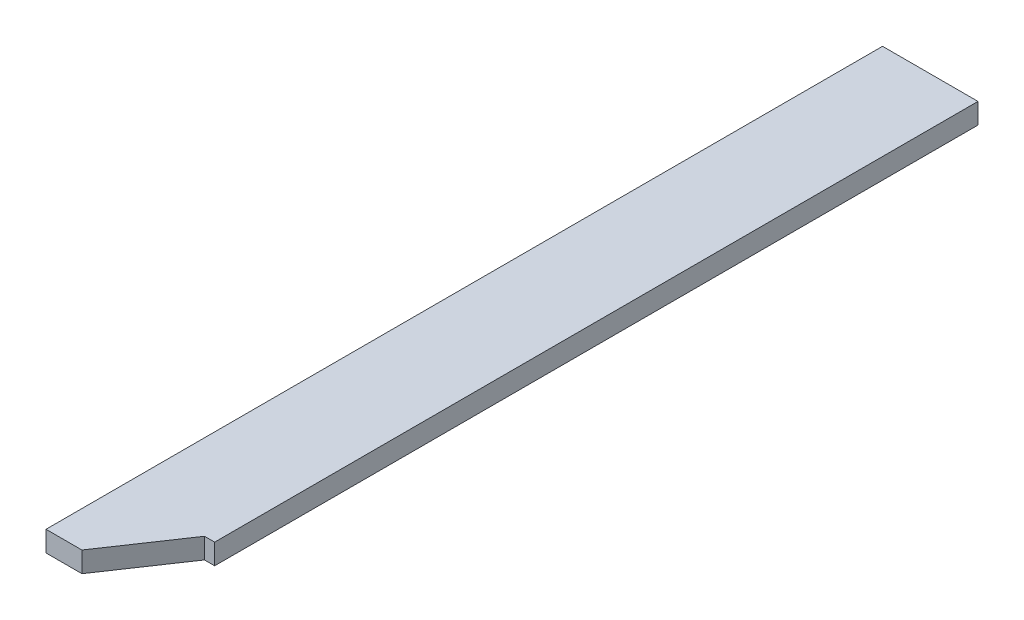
ISO-10303-21;
HEADER;
FILE_DESCRIPTION(('STEP AP214'),'2;1');
FILE_NAME('part.step','',(''),(''),'','','');
FILE_SCHEMA(('AUTOMOTIVE_DESIGN { 1 0 10303 214 1 1 1 1 }'));
ENDSEC;
DATA;
#1=APPLICATION_CONTEXT('core data for automotive mechanical design processes');
#2=APPLICATION_PROTOCOL_DEFINITION('international standard','automotive_design',2000,#1);
#3=PRODUCT_CONTEXT('',#1,'mechanical');
#4=PRODUCT('Part','Part','',(#3));
#5=PRODUCT_RELATED_PRODUCT_CATEGORY('part','',(#4));
#6=PRODUCT_DEFINITION_FORMATION('','',#4);
#7=PRODUCT_DEFINITION_CONTEXT('part definition',#1,'design');
#8=PRODUCT_DEFINITION('design','',#6,#7);
#9=PRODUCT_DEFINITION_SHAPE('','',#8);
#10=(LENGTH_UNIT() NAMED_UNIT(*) SI_UNIT(.MILLI.,.METRE.));
#11=(NAMED_UNIT(*) PLANE_ANGLE_UNIT() SI_UNIT($,.RADIAN.));
#12=(NAMED_UNIT(*) SI_UNIT($,.STERADIAN.) SOLID_ANGLE_UNIT());
#13=UNCERTAINTY_MEASURE_WITH_UNIT(LENGTH_MEASURE(1.E-05),#10,'distance_accuracy_value','');
#14=(GEOMETRIC_REPRESENTATION_CONTEXT(3) GLOBAL_UNCERTAINTY_ASSIGNED_CONTEXT((#13)) GLOBAL_UNIT_ASSIGNED_CONTEXT((#10,
#11,#12)) REPRESENTATION_CONTEXT('',''));
#15=CARTESIAN_POINT('',(0.,0.,0.));
#16=DIRECTION('',(0.,0.,1.));
#17=DIRECTION('',(1.,0.,0.));
#18=AXIS2_PLACEMENT_3D('',#15,#16,#17);
#19=CARTESIAN_POINT('',(295.275,127.,-2587.67072));
#20=DIRECTION('',(-1.,0.,0.));
#21=DIRECTION('',(0.,0.,1.));
#22=AXIS2_PLACEMENT_3D('',#19,#20,#21);
#23=PLANE('',#22);
#24=DIRECTION('',(0.,0.,-1.));
#25=VECTOR('',#24,1.);
#26=CARTESIAN_POINT('',(295.275,127.,-2587.67072));
#27=LINE('',#26,#25);
#28=CARTESIAN_POINT('',(295.275,127.,2134.93330162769));
#29=VERTEX_POINT('',#28);
#30=CARTESIAN_POINT('',(295.275,127.,-2587.67072));
#31=VERTEX_POINT('',#30);
#32=EDGE_CURVE('E77',#29,#31,#27,.T.);
#33=ORIENTED_EDGE('',*,*,#32,.F.);
#34=DIRECTION('',(0.,-1.,0.));
#35=VECTOR('',#34,1.);
#36=CARTESIAN_POINT('',(295.275,127.,2134.93330162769));
#37=LINE('',#36,#35);
#38=CARTESIAN_POINT('',(295.275,0.,2134.93330162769));
#39=VERTEX_POINT('',#38);
#40=EDGE_CURVE('E119',#29,#39,#37,.T.);
#41=ORIENTED_EDGE('',*,*,#40,.T.);
#42=DIRECTION('',(0.,0.,-1.));
#43=VECTOR('',#42,1.);
#44=CARTESIAN_POINT('',(295.275,0.,-2587.67072));
#45=LINE('',#44,#43);
#46=CARTESIAN_POINT('',(295.275,0.,-2587.67072));
#47=VERTEX_POINT('',#46);
#48=EDGE_CURVE('E116',#39,#47,#45,.T.);
#49=ORIENTED_EDGE('',*,*,#48,.T.);
#50=DIRECTION('',(0.,-1.,0.));
#51=VECTOR('',#50,1.);
#52=CARTESIAN_POINT('',(295.275,127.,-2587.67072));
#53=LINE('',#52,#51);
#54=EDGE_CURVE('E11',#31,#47,#53,.T.);
#55=ORIENTED_EDGE('',*,*,#54,.F.);
#56=EDGE_LOOP('',(#33,#41,#49,#55));
#57=FACE_BOUND('',#56,.T.);
#58=ADVANCED_FACE('F32',(#57),#23,.F.);
#59=CARTESIAN_POINT('',(-295.275,127.,-2587.67072));
#60=DIRECTION('',(0.,0.,1.));
#61=DIRECTION('',(1.,0.,0.));
#62=AXIS2_PLACEMENT_3D('',#59,#60,#61);
#63=PLANE('',#62);
#64=DIRECTION('',(-1.,0.,0.));
#65=VECTOR('',#64,1.);
#66=CARTESIAN_POINT('',(-295.275,0.,-2587.67072));
#67=LINE('',#66,#65);
#68=CARTESIAN_POINT('',(-295.275,0.,-2587.67072));
#69=VERTEX_POINT('',#68);
#70=EDGE_CURVE('E118',#47,#69,#67,.T.);
#71=ORIENTED_EDGE('',*,*,#70,.T.);
#72=DIRECTION('',(0.,-1.,0.));
#73=VECTOR('',#72,1.);
#74=CARTESIAN_POINT('',(-295.275,127.,-2587.67072));
#75=LINE('',#74,#73);
#76=CARTESIAN_POINT('',(-295.275,127.,-2587.67072));
#77=VERTEX_POINT('',#76);
#78=EDGE_CURVE('E39',#77,#69,#75,.T.);
#79=ORIENTED_EDGE('',*,*,#78,.F.);
#80=DIRECTION('',(-1.,0.,0.));
#81=VECTOR('',#80,1.);
#82=CARTESIAN_POINT('',(-295.275,127.,-2587.67072));
#83=LINE('',#82,#81);
#84=EDGE_CURVE('E112',#31,#77,#83,.T.);
#85=ORIENTED_EDGE('',*,*,#84,.F.);
#86=ORIENTED_EDGE('',*,*,#54,.T.);
#87=EDGE_LOOP('',(#71,#79,#85,#86));
#88=FACE_BOUND('',#87,.T.);
#89=ADVANCED_FACE('F139',(#88),#63,.F.);
#90=CARTESIAN_POINT('',(-295.275,127.,-2587.67072));
#91=DIRECTION('',(1.,0.,0.));
#92=DIRECTION('',(0.,0.,-1.));
#93=AXIS2_PLACEMENT_3D('',#90,#91,#92);
#94=PLANE('',#93);
#95=DIRECTION('',(0.,0.,1.));
#96=VECTOR('',#95,1.);
#97=CARTESIAN_POINT('',(-295.275,0.,-2587.67072));
#98=LINE('',#97,#96);
#99=CARTESIAN_POINT('',(-295.275,0.,2587.67072));
#100=VERTEX_POINT('',#99);
#101=EDGE_CURVE('E72',#69,#100,#98,.T.);
#102=ORIENTED_EDGE('',*,*,#101,.T.);
#103=DIRECTION('',(0.,-1.,0.));
#104=VECTOR('',#103,1.);
#105=CARTESIAN_POINT('',(-295.275,127.,2587.67072));
#106=LINE('',#105,#104);
#107=CARTESIAN_POINT('',(-295.275,127.,2587.67072));
#108=VERTEX_POINT('',#107);
#109=EDGE_CURVE('E109',#108,#100,#106,.T.);
#110=ORIENTED_EDGE('',*,*,#109,.F.);
#111=DIRECTION('',(0.,0.,1.));
#112=VECTOR('',#111,1.);
#113=CARTESIAN_POINT('',(-295.275,127.,-2587.67072));
#114=LINE('',#113,#112);
#115=EDGE_CURVE('E55',#77,#108,#114,.T.);
#116=ORIENTED_EDGE('',*,*,#115,.F.);
#117=ORIENTED_EDGE('',*,*,#78,.T.);
#118=EDGE_LOOP('',(#102,#110,#116,#117));
#119=FACE_BOUND('',#118,.T.);
#120=ADVANCED_FACE('F123',(#119),#94,.F.);
#121=CARTESIAN_POINT('',(-295.275,127.,2587.67072));
#122=DIRECTION('',(0.,0.,-1.));
#123=DIRECTION('',(-1.,0.,0.));
#124=AXIS2_PLACEMENT_3D('',#121,#122,#123);
#125=PLANE('',#124);
#126=DIRECTION('',(1.,0.,0.));
#127=VECTOR('',#126,1.);
#128=CARTESIAN_POINT('',(-295.275,0.,2587.67072));
#129=LINE('',#128,#127);
#130=CARTESIAN_POINT('',(-73.0249999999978,0.,2587.67072));
#131=VERTEX_POINT('',#130);
#132=EDGE_CURVE('E106',#100,#131,#129,.T.);
#133=ORIENTED_EDGE('',*,*,#132,.T.);
#134=DIRECTION('',(0.,-1.,0.));
#135=VECTOR('',#134,1.);
#136=CARTESIAN_POINT('',(-73.0249999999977,127.,2587.67072));
#137=LINE('',#136,#135);
#138=CARTESIAN_POINT('',(-73.0249999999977,127.,2587.67072));
#139=VERTEX_POINT('',#138);
#140=EDGE_CURVE('E46',#139,#131,#137,.T.);
#141=ORIENTED_EDGE('',*,*,#140,.F.);
#142=DIRECTION('',(1.,0.,0.));
#143=VECTOR('',#142,1.);
#144=CARTESIAN_POINT('',(-295.275,127.,2587.67072));
#145=LINE('',#144,#143);
#146=EDGE_CURVE('E104',#108,#139,#145,.T.);
#147=ORIENTED_EDGE('',*,*,#146,.F.);
#148=ORIENTED_EDGE('',*,*,#109,.T.);
#149=EDGE_LOOP('',(#133,#141,#147,#148));
#150=FACE_BOUND('',#149,.T.);
#151=ADVANCED_FACE('F103',(#150),#125,.F.);
#152=CARTESIAN_POINT('',(295.275,127.,2587.67072));
#153=DIRECTION('',(0.,1.,0.));
#154=DIRECTION('',(0.,0.,1.));
#155=AXIS2_PLACEMENT_3D('',#152,#153,#154);
#156=PLANE('',#155);
#157=DIRECTION('',(1.,0.,0.));
#158=VECTOR('',#157,1.);
#159=CARTESIAN_POINT('',(295.275,127.,2134.93330162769));
#160=LINE('',#159,#158);
#161=CARTESIAN_POINT('',(232.350244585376,127.,2134.93330162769));
#162=VERTEX_POINT('',#161);
#163=EDGE_CURVE('E97',#162,#29,#160,.T.);
#164=ORIENTED_EDGE('',*,*,#163,.T.);
#165=ORIENTED_EDGE('',*,*,#32,.T.);
#166=ORIENTED_EDGE('',*,*,#84,.T.);
#167=ORIENTED_EDGE('',*,*,#115,.T.);
#168=ORIENTED_EDGE('',*,*,#146,.T.);
#169=DIRECTION('',(0.559192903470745,0.,-0.829037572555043));
#170=VECTOR('',#169,1.);
#171=CARTESIAN_POINT('',(232.350244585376,127.,2134.93330162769));
#172=LINE('',#171,#170);
#173=EDGE_CURVE('E93',#139,#162,#172,.T.);
#174=ORIENTED_EDGE('',*,*,#173,.T.);
#175=EDGE_LOOP('',(#164,#165,#166,#167,#168,#174));
#176=FACE_BOUND('',#175,.T.);
#177=ADVANCED_FACE('F108',(#176),#156,.T.);
#178=CARTESIAN_POINT('',(295.275,0.,2587.67072));
#179=DIRECTION('',(0.,1.,0.));
#180=DIRECTION('',(0.,0.,1.));
#181=AXIS2_PLACEMENT_3D('',#178,#179,#180);
#182=PLANE('',#181);
#183=ORIENTED_EDGE('',*,*,#48,.F.);
#184=DIRECTION('',(1.,0.,0.));
#185=VECTOR('',#184,1.);
#186=CARTESIAN_POINT('',(295.275,0.,2134.93330162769));
#187=LINE('',#186,#185);
#188=CARTESIAN_POINT('',(232.350244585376,0.,2134.93330162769));
#189=VERTEX_POINT('',#188);
#190=EDGE_CURVE('E98',#189,#39,#187,.T.);
#191=ORIENTED_EDGE('',*,*,#190,.F.);
#192=DIRECTION('',(0.559192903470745,0.,-0.829037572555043));
#193=VECTOR('',#192,1.);
#194=CARTESIAN_POINT('',(232.350244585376,0.,2134.93330162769));
#195=LINE('',#194,#193);
#196=EDGE_CURVE('E130',#131,#189,#195,.T.);
#197=ORIENTED_EDGE('',*,*,#196,.F.);
#198=ORIENTED_EDGE('',*,*,#132,.F.);
#199=ORIENTED_EDGE('',*,*,#101,.F.);
#200=ORIENTED_EDGE('',*,*,#70,.F.);
#201=EDGE_LOOP('',(#183,#191,#197,#198,#199,#200));
#202=FACE_BOUND('',#201,.T.);
#203=ADVANCED_FACE('F128',(#202),#182,.F.);
#204=CARTESIAN_POINT('',(295.275,127.,2134.93330162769));
#205=DIRECTION('',(0.,0.,-1.));
#206=DIRECTION('',(-1.,0.,0.));
#207=AXIS2_PLACEMENT_3D('',#204,#205,#206);
#208=PLANE('',#207);
#209=ORIENTED_EDGE('',*,*,#190,.T.);
#210=ORIENTED_EDGE('',*,*,#40,.F.);
#211=ORIENTED_EDGE('',*,*,#163,.F.);
#212=DIRECTION('',(0.,-1.,0.));
#213=VECTOR('',#212,1.);
#214=CARTESIAN_POINT('',(232.350244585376,127.,2134.93330162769));
#215=LINE('',#214,#213);
#216=EDGE_CURVE('E95',#162,#189,#215,.T.);
#217=ORIENTED_EDGE('',*,*,#216,.T.);
#218=EDGE_LOOP('',(#209,#210,#211,#217));
#219=FACE_BOUND('',#218,.T.);
#220=ADVANCED_FACE('F142',(#219),#208,.F.);
#221=CARTESIAN_POINT('',(232.350244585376,127.,2134.93330162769));
#222=DIRECTION('',(-0.829037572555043,0.,-0.559192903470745));
#223=DIRECTION('',(-0.559192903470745,0.,0.829037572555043));
#224=AXIS2_PLACEMENT_3D('',#221,#222,#223);
#225=PLANE('',#224);
#226=ORIENTED_EDGE('',*,*,#196,.T.);
#227=ORIENTED_EDGE('',*,*,#216,.F.);
#228=ORIENTED_EDGE('',*,*,#173,.F.);
#229=ORIENTED_EDGE('',*,*,#140,.T.);
#230=EDGE_LOOP('',(#226,#227,#228,#229));
#231=FACE_BOUND('',#230,.T.);
#232=ADVANCED_FACE('F94',(#231),#225,.F.);
#233=CLOSED_SHELL('',(#58,#89,#120,#151,#177,#203,#220,#232));
#234=MANIFOLD_SOLID_BREP('B2',#233);
#235=ADVANCED_BREP_SHAPE_REPRESENTATION('',(#18,#234),#14);
#236=SHAPE_DEFINITION_REPRESENTATION(#9,#235);
ENDSEC;
END-ISO-10303-21;
